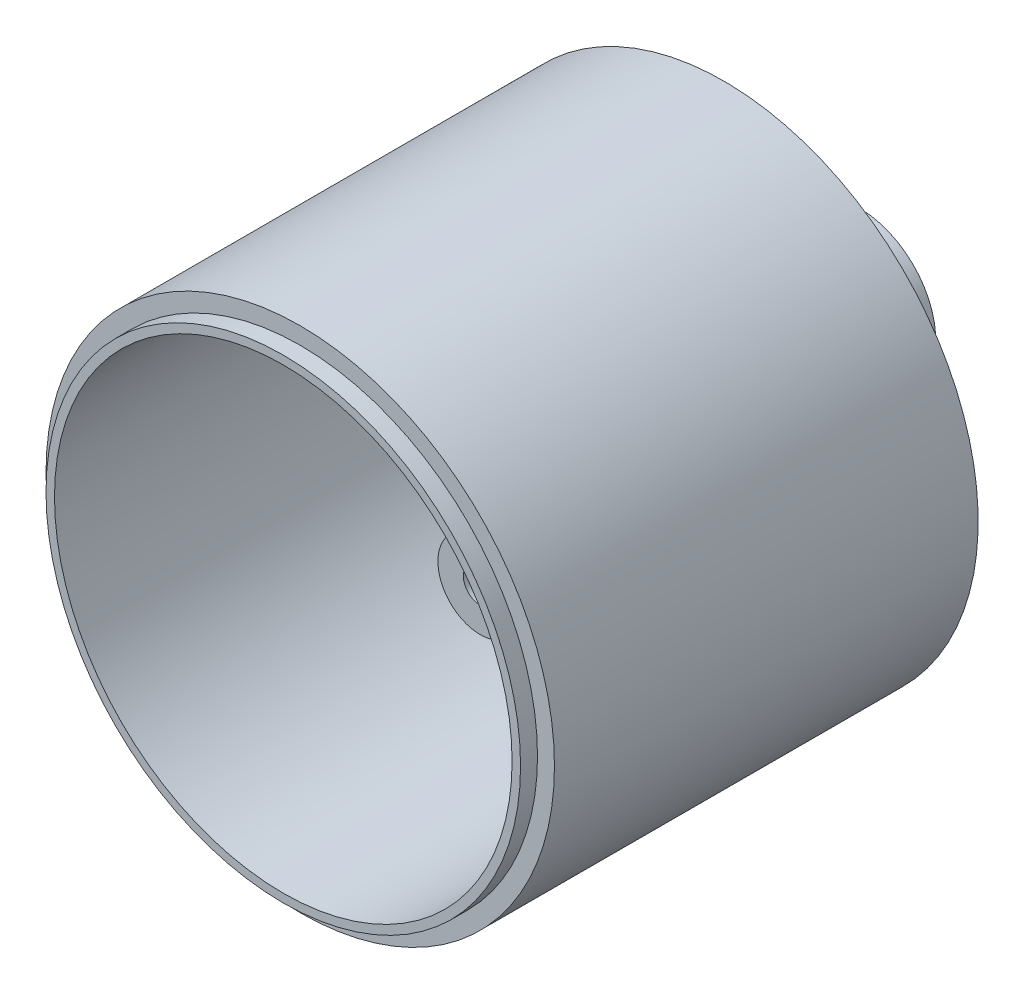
from build123d import *

# Parameters (mm, degrees)
ESQUISSE1_R                    = 15
CENTRAGE_CORPS_DEPTH           = 2.75
ESQUISSE2_R                    = 15
LOGEMENT_PIGNONERIE_DEPTH      = 19.5
ESQUISSE3_R                    = 5
BOSSAGE_DEPTH                  = 2
ESQUISSE4_R                    = 4.5
GUIDAGE_DE_SORTIE_DEPTH        = 6
COQUE_T                        = -1.5
ESQUISSE6_R                    = 2
SORTIE_DEPTH                   = 40.230090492
ESQUISSE8_R                    = 2.5
ESQUISSE8_R_2                  = 1
BOSSAGE_AXE_1_DEPTH            = 9.5
ESQUISSE11_R                   = 2.5
ESQUISSE11_R_2                 = 1
BOSSAGE_AXE_2_DEPTH            = 3
LISER_START                    = 1
ESQUISSE9_R                    = 14
ESQUISSE9_R_2                  = 13.5
LISER_DEPTH                    = 1
ESQUISSE12_R                   = 6
PASSAGE_PIGNON_DE_SORTIE_DEPTH = 33.407560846


with BuildPart() as part:
    # Esquisse1 → Centrage corps (new, symmetric)
    with BuildSketch(Plane.XY):
        Circle(ESQUISSE1_R)
    extrude(amount=CENTRAGE_CORPS_DEPTH, both=True)

    # Esquisse2 → Logement pignonerie (add)
    with BuildSketch(Plane(origin=(0, 0, -2.75), x_dir=(-1, 0, 0), z_dir=(0, 0, -1))):
        Circle(ESQUISSE2_R)
    extrude(amount=LOGEMENT_PIGNONERIE_DEPTH)

    # Esquisse3 → Bossage (add)
    with BuildSketch(Plane(origin=(0, 0, -22.25), x_dir=(-1, 0, 0), z_dir=(0, 0, -1))):
        Circle(ESQUISSE3_R)
    extrude(amount=BOSSAGE_DEPTH)

    # Esquisse4 → Guidage de sortie (add)
    with BuildSketch(Plane(origin=(0, 0, -24.25), x_dir=(-1, 0, 0), z_dir=(0, 0, -1))):
        Circle(ESQUISSE4_R)
    extrude(amount=GUIDAGE_DE_SORTIE_DEPTH)

    # Coque
    coque_openings = [part.faces().sort_by_distance(p)[0] for p in [
        (0, 0, 2.75),
    ]]
    offset(amount=COQUE_T, openings=coque_openings, kind=Kind.INTERSECTION)

    # Esquisse6 → Sortie (cut, through all)
    with BuildSketch(Plane(origin=(0, 0, -30.25), x_dir=(-1, 0, 0), z_dir=(0, 0, -1))):
        Circle(ESQUISSE6_R)
    extrude(amount=-SORTIE_DEPTH, mode=Mode.SUBTRACT)

    # Esquisse8 → Bossage axe 1 (add)
    with BuildSketch(Plane.XY.offset(-20.75)):
        with Locations((-3.375, -6.976523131)):
            Circle(ESQUISSE8_R)
        with Locations((-3.375, -6.976523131)):
            Circle(ESQUISSE8_R_2, mode=Mode.SUBTRACT)
    extrude(amount=BOSSAGE_AXE_1_DEPTH)

    # Esquisse11 → Bossage axe 2 (add)
    with BuildSketch(Plane.XY.offset(-20.75)):
        with Locations((3.369215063, -7.255921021)):
            Circle(ESQUISSE11_R)
        with Locations((3.369215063, -7.255921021)):
            Circle(ESQUISSE11_R_2, mode=Mode.SUBTRACT)
    extrude(amount=BOSSAGE_AXE_2_DEPTH)

    # Esquisse9 → Liser (add)
    with BuildSketch(Plane.XY.offset(2.75).offset(LISER_START)):
        Circle(ESQUISSE9_R)
        Circle(ESQUISSE9_R_2, mode=Mode.SUBTRACT)
    extrude(amount=-LISER_DEPTH)

    # Esquisse12 → Passage pignon de sortie (cut, through all)
    with BuildSketch(Plane.XY.offset(-20.75)):
        Circle(ESQUISSE12_R)
    extrude(amount=PASSAGE_PIGNON_DE_SORTIE_DEPTH, mode=Mode.SUBTRACT)


solid = part.part
